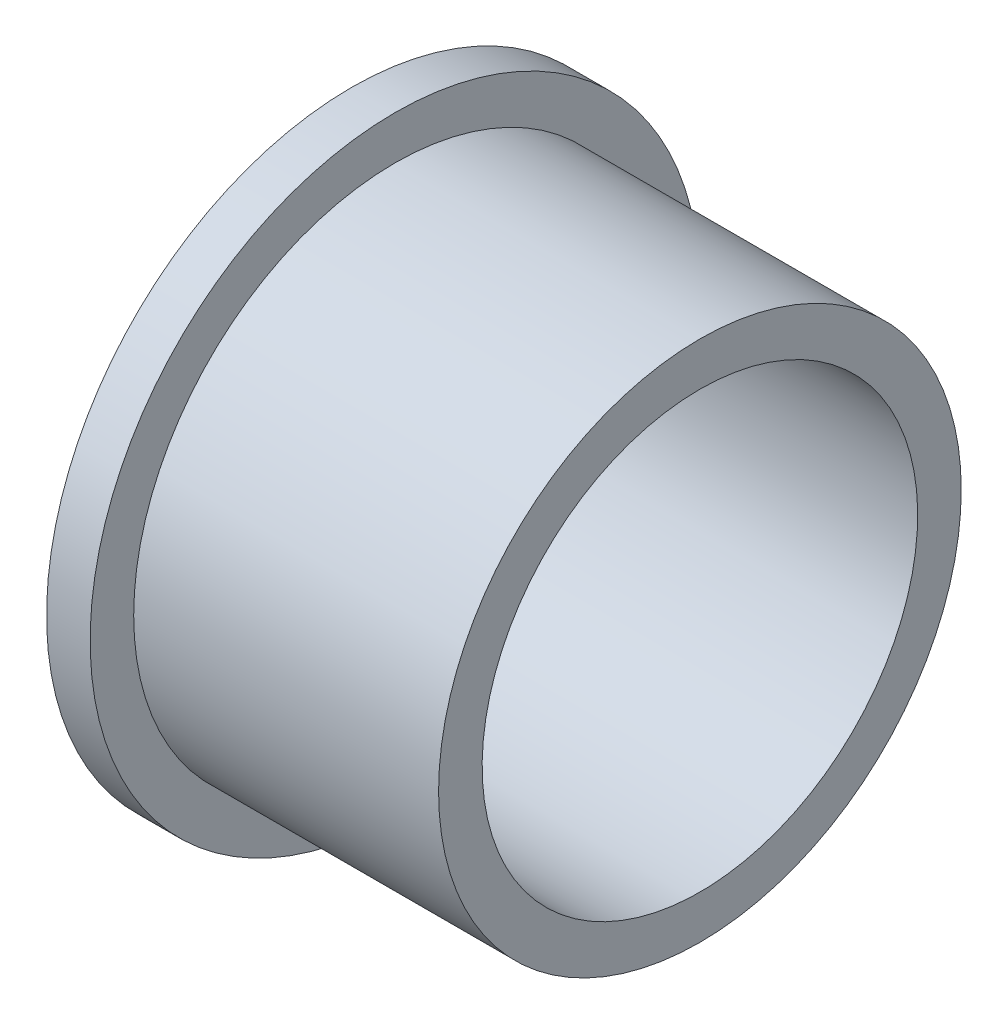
from build123d import *


with BuildPart() as part:
    # Schizzo1 → Rivoluzione1 (revolve)
    with BuildSketch(Plane.XY):
        Polygon((-20, 12.5), (-20, 17.5), (-17.5, 17.5), (-17.5, 15), (0, 15), (0, 12.5), align=None)
    revolve(axis=Axis((0, 0, 0), (-1, 0, 0)))


solid = part.part
